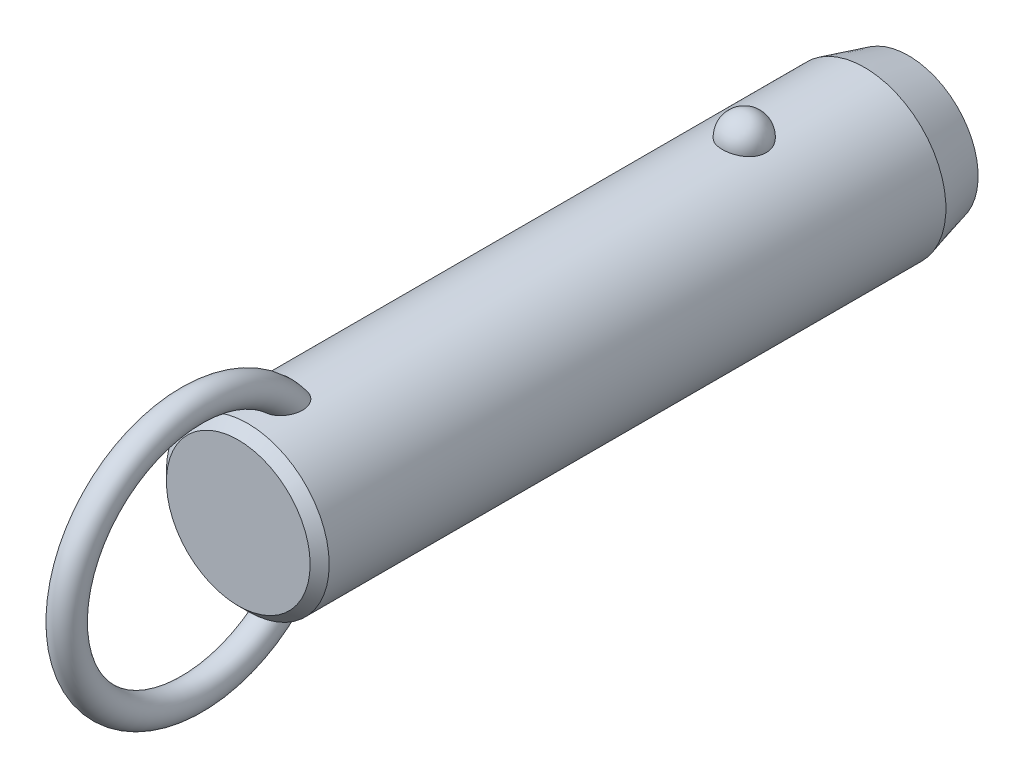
ISO-10303-21;
HEADER;
FILE_DESCRIPTION(('STEP AP214'),'2;1');
FILE_NAME('part.step','',(''),(''),'','','');
FILE_SCHEMA(('AUTOMOTIVE_DESIGN { 1 0 10303 214 1 1 1 1 }'));
ENDSEC;
DATA;
#1=APPLICATION_CONTEXT('core data for automotive mechanical design processes');
#2=APPLICATION_PROTOCOL_DEFINITION('international standard','automotive_design',2000,#1);
#3=PRODUCT_CONTEXT('',#1,'mechanical');
#4=PRODUCT('Part','Part','',(#3));
#5=PRODUCT_RELATED_PRODUCT_CATEGORY('part','',(#4));
#6=PRODUCT_DEFINITION_FORMATION('','',#4);
#7=PRODUCT_DEFINITION_CONTEXT('part definition',#1,'design');
#8=PRODUCT_DEFINITION('design','',#6,#7);
#9=PRODUCT_DEFINITION_SHAPE('','',#8);
#10=(LENGTH_UNIT() NAMED_UNIT(*) SI_UNIT(.MILLI.,.METRE.));
#11=(NAMED_UNIT(*) PLANE_ANGLE_UNIT() SI_UNIT($,.RADIAN.));
#12=(NAMED_UNIT(*) SI_UNIT($,.STERADIAN.) SOLID_ANGLE_UNIT());
#13=UNCERTAINTY_MEASURE_WITH_UNIT(LENGTH_MEASURE(1.E-05),#10,'distance_accuracy_value','');
#14=(GEOMETRIC_REPRESENTATION_CONTEXT(3) GLOBAL_UNCERTAINTY_ASSIGNED_CONTEXT((#13)) GLOBAL_UNIT_ASSIGNED_CONTEXT((#10,
#11,#12)) REPRESENTATION_CONTEXT('',''));
#15=CARTESIAN_POINT('',(0.,0.,0.));
#16=DIRECTION('',(0.,0.,1.));
#17=DIRECTION('',(1.,0.,0.));
#18=AXIS2_PLACEMENT_3D('',#15,#16,#17);
#19=CARTESIAN_POINT('',(0.,0.,53.3));
#20=DIRECTION('',(0.,0.,-1.));
#21=DIRECTION('',(-1.,0.,0.));
#22=AXIS2_PLACEMENT_3D('',#19,#20,#21);
#23=CYLINDRICAL_SURFACE('',#22,11.1);
#24=CARTESIAN_POINT('',(2.9724815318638,10.6945945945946,-3.));
#25=CARTESIAN_POINT('',(2.97247830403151,10.6945972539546,-2.83225059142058));
#26=CARTESIAN_POINT('',(2.95876598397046,10.6984356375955,-2.66445972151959));
#27=CARTESIAN_POINT('',(2.90424529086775,10.7133624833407,-2.33362381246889));
#28=CARTESIAN_POINT('',(2.8634252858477,10.7244540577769,-2.1705808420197));
#29=CARTESIAN_POINT('',(2.75573657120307,10.7526272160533,-1.85396767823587));
#30=CARTESIAN_POINT('',(2.68887937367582,10.7697061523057,-1.70039333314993));
#31=CARTESIAN_POINT('',(2.53079696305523,10.8079438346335,-1.40691598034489));
#32=CARTESIAN_POINT('',(2.43957264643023,10.8291024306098,-1.2670124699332));
#33=CARTESIAN_POINT('',(2.23458150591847,10.8732541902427,-1.00409565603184));
#34=CARTESIAN_POINT('',(2.12071295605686,10.8962553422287,-0.881162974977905));
#35=CARTESIAN_POINT('',(1.87365402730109,10.9414421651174,-0.656352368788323));
#36=CARTESIAN_POINT('',(1.74046358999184,10.9636278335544,-0.554474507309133));
#37=CARTESIAN_POINT('',(1.45872188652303,11.0046495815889,-0.374872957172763));
#38=CARTESIAN_POINT('',(1.31021276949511,11.0234944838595,-0.297085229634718));
#39=CARTESIAN_POINT('',(1.00170030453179,11.0557957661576,-0.167529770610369));
#40=CARTESIAN_POINT('',(0.841698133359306,11.0692526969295,-0.115759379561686));
#41=CARTESIAN_POINT('',(0.517607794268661,11.0890932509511,-0.0403925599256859));
#42=CARTESIAN_POINT('',(0.353633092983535,11.0955916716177,-0.0163383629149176));
#43=CARTESIAN_POINT('',(0.0238420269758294,11.1011989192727,0.0044517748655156));
#44=CARTESIAN_POINT('',(-0.141974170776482,11.1003084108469,0.00119017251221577));
#45=CARTESIAN_POINT('',(-0.468405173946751,11.0912990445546,-0.0323233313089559));
#46=CARTESIAN_POINT('',(-0.629059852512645,11.0832767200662,-0.0622147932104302));
#47=CARTESIAN_POINT('',(-0.942937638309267,11.0609962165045,-0.147645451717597));
#48=CARTESIAN_POINT('',(-1.09616062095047,11.0467379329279,-0.203185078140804));
#49=CARTESIAN_POINT('',(-1.39181061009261,11.0134071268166,-0.3387529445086));
#50=CARTESIAN_POINT('',(-1.53417383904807,10.9943086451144,-0.418913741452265));
#51=CARTESIAN_POINT('',(-1.80342160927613,10.9533667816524,-0.60144882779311));
#52=CARTESIAN_POINT('',(-1.9303046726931,10.9315231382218,-0.703825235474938));
#53=CARTESIAN_POINT('',(-2.16747598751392,10.887005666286,-0.930091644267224));
#54=CARTESIAN_POINT('',(-2.27742774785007,10.8643239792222,-1.05433291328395));
#55=CARTESIAN_POINT('',(-2.47517316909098,10.8209886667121,-1.31966633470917));
#56=CARTESIAN_POINT('',(-2.56296538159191,10.8003351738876,-1.46075958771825));
#57=CARTESIAN_POINT('',(-2.71500300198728,10.7631304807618,-1.75753646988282));
#58=CARTESIAN_POINT('',(-2.77898901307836,10.7466250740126,-1.91335887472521));
#59=CARTESIAN_POINT('',(-2.88046189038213,10.7198747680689,-2.2339152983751));
#60=CARTESIAN_POINT('',(-2.91794947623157,10.709629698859,-2.39864907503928));
#61=CARTESIAN_POINT('',(-2.96537819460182,10.6965949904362,-2.73165170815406));
#62=CARTESIAN_POINT('',(-2.97542891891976,10.693775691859,-2.89990378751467));
#63=CARTESIAN_POINT('',(-2.96804271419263,10.6958279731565,-3.235752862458));
#64=CARTESIAN_POINT('',(-2.95060646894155,10.7006993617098,-3.40334987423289));
#65=CARTESIAN_POINT('',(-2.88883358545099,10.71753912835,-3.73233906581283));
#66=CARTESIAN_POINT('',(-2.84462026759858,10.7294749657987,-3.89375610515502));
#67=CARTESIAN_POINT('',(-2.73050447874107,10.7590797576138,-4.20667949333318));
#68=CARTESIAN_POINT('',(-2.66060103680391,10.7767489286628,-4.35818546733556));
#69=CARTESIAN_POINT('',(-2.49642559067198,10.8159599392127,-4.6478542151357));
#70=CARTESIAN_POINT('',(-2.40203047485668,10.8375211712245,-4.78594458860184));
#71=CARTESIAN_POINT('',(-2.19143488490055,10.8820570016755,-5.0441038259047));
#72=CARTESIAN_POINT('',(-2.07523364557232,10.9050316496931,-5.16417205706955));
#73=CARTESIAN_POINT('',(-1.82361254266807,10.9499219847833,-5.38334833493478));
#74=CARTESIAN_POINT('',(-1.68812945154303,10.9718338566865,-5.48238464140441));
#75=CARTESIAN_POINT('',(-1.40191298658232,11.0120611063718,-5.65618873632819));
#76=CARTESIAN_POINT('',(-1.25118062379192,11.0303767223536,-5.73095813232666));
#77=CARTESIAN_POINT('',(-0.940570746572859,11.0611653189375,-5.85334725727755));
#78=CARTESIAN_POINT('',(-0.780821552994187,11.0737044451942,-5.90127578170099));
#79=CARTESIAN_POINT('',(-0.455204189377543,11.0918598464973,-5.96992976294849));
#80=CARTESIAN_POINT('',(-0.289336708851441,11.0974768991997,-5.99065827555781));
#81=CARTESIAN_POINT('',(0.0406846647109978,11.1011307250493,-6.00418773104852));
#82=CARTESIAN_POINT('',(0.204817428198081,11.099299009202,-5.99747318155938));
#83=CARTESIAN_POINT('',(0.5295530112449,11.088551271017,-5.9574031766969));
#84=CARTESIAN_POINT('',(0.69015594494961,11.0796354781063,-5.92404858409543));
#85=CARTESIAN_POINT('',(1.0027760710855,11.0557204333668,-5.83180084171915));
#86=CARTESIAN_POINT('',(1.15482001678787,11.0407414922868,-5.77299291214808));
#87=CARTESIAN_POINT('',(1.44678373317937,11.0062913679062,-5.63147366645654));
#88=CARTESIAN_POINT('',(1.58670279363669,10.9868199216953,-5.54876095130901));
#89=CARTESIAN_POINT('',(1.8527023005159,10.9451315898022,-5.36027644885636));
#90=CARTESIAN_POINT('',(1.97855158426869,10.9228788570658,-5.25418644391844));
#91=CARTESIAN_POINT('',(2.21080872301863,10.8782509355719,-5.02251354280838));
#92=CARTESIAN_POINT('',(2.31721312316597,10.8558757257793,-4.89692718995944));
#93=CARTESIAN_POINT('',(2.5094551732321,10.8130715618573,-4.62745408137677));
#94=CARTESIAN_POINT('',(2.59493284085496,10.7926798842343,-4.48330448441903));
#95=CARTESIAN_POINT('',(2.740862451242,10.7565495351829,-4.18236358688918));
#96=CARTESIAN_POINT('',(2.80132490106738,10.7408089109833,-4.02557762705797));
#97=CARTESIAN_POINT('',(2.88959070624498,10.7173718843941,-3.72475308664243));
#98=CARTESIAN_POINT('',(2.92062102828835,10.7088950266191,-3.58171216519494));
#99=CARTESIAN_POINT('',(2.96206765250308,10.6975052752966,-3.29245795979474));
#100=CARTESIAN_POINT('',(2.97248434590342,10.6945922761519,-3.14624473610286));
#101=CARTESIAN_POINT('',(2.9724815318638,10.6945945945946,-3.));
#102=B_SPLINE_CURVE_WITH_KNOTS('',3,(#24,#25,#26,#27,#28,#29,#30,#31,#32,#33,#34,#35,#36,#37,
#38,#39,#40,#41,#42,#43,#44,#45,#46,#47,#48,#49,#50,#51,#52,#53,#54,#55,#56,#57,#58,#59,#60,#61,
#62,#63,#64,#65,#66,#67,#68,#69,#70,#71,#72,#73,#74,#75,#76,#77,#78,#79,#80,#81,#82,#83,#84,#85,
#86,#87,#88,#89,#90,#91,#92,#93,#94,#95,#96,#97,#98,#99,#100,#101),.UNSPECIFIED.,.T.,.F.,(4,2,2,
2,2,2,2,2,2,2,2,2,2,2,2,2,2,2,2,2,2,2,2,2,2,2,2,2,2,2,2,2,2,2,2,2,2,2,4),(0.,0.502722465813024,
1.00566079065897,1.5083769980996,2.01107471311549,2.51608392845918,3.02109467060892,
3.52475118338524,4.02835620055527,4.523518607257,5.0186364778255,5.50715297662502,
5.9956776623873,6.48688002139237,6.97812923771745,7.47814366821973,7.9781907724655,
8.48353712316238,8.9888697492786,9.49218093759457,9.99547960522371,10.4964777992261,
10.997494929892,11.5010810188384,12.0046847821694,12.5099796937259,13.0152411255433,
13.5145635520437,14.0138298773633,14.5043200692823,14.9947943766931,15.4836390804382,
15.9725123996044,16.4685040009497,16.9645836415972,17.4686765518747,17.972557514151,
18.410841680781,18.849117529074),.UNSPECIFIED.);
#103=CARTESIAN_POINT('',(2.9724815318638,10.6945945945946,-3.));
#104=VERTEX_POINT('',#103);
#105=EDGE_CURVE('E41',#104,#104,#102,.T.);
#106=ORIENTED_EDGE('',*,*,#105,.T.);
#107=EDGE_LOOP('',(#106));
#108=FACE_BOUND('',#107,.T.);
#109=CARTESIAN_POINT('',(0.,0.,64.7));
#110=DIRECTION('',(0.,0.,1.));
#111=DIRECTION('',(1.,0.,0.));
#112=AXIS2_PLACEMENT_3D('',#109,#110,#111);
#113=CIRCLE('',#112,11.1);
#114=CARTESIAN_POINT('',(11.1,0.,64.7));
#115=VERTEX_POINT('',#114);
#116=EDGE_CURVE('E10',#115,#115,#113,.F.);
#117=ORIENTED_EDGE('',*,*,#116,.T.);
#118=EDGE_LOOP('',(#117));
#119=FACE_BOUND('',#118,.T.);
#120=CARTESIAN_POINT('',(-0.56452033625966,-11.0856356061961,56.9578154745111));
#121=CARTESIAN_POINT('',(-0.66720283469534,-11.0804062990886,56.9912839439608));
#122=CARTESIAN_POINT('',(-0.766875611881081,-11.0738877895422,57.0338357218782));
#123=CARTESIAN_POINT('',(-0.957284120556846,-11.0590576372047,57.1354190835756));
#124=CARTESIAN_POINT('',(-1.04801616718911,-11.0507452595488,57.1944574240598));
#125=CARTESIAN_POINT('',(-1.21800952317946,-11.0333016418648,57.3265293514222));
#126=CARTESIAN_POINT('',(-1.29730805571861,-11.0241732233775,57.3995156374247));
#127=CARTESIAN_POINT('',(-1.44337665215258,-11.0060026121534,57.5570374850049));
#128=CARTESIAN_POINT('',(-1.51014622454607,-10.9969604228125,57.6415734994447));
#129=CARTESIAN_POINT('',(-1.63454620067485,-10.9791841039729,57.8255213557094));
#130=CARTESIAN_POINT('',(-1.69127003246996,-10.9705107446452,57.9255493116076));
#131=CARTESIAN_POINT('',(-1.78980785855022,-10.9548648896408,58.1327902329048));
#132=CARTESIAN_POINT('',(-1.83161214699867,-10.9478935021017,58.2400078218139));
#133=CARTESIAN_POINT('',(-1.91557028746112,-10.9335803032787,58.5054080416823));
#134=CARTESIAN_POINT('',(-1.95040620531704,-10.9273269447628,58.6659806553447));
#135=CARTESIAN_POINT('',(-1.99388326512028,-10.9194709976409,58.9906977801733));
#136=CARTESIAN_POINT('',(-2.00248051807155,-10.9178762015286,59.1548478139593));
#137=CARTESIAN_POINT('',(-1.99551615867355,-10.9191578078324,59.5246504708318));
#138=CARTESIAN_POINT('',(-1.9732206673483,-10.9232807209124,59.7301911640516));
#139=CARTESIAN_POINT('',(-1.9152976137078,-10.9335244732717,60.033595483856));
#140=CARTESIAN_POINT('',(-1.89184575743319,-10.9376266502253,60.1340883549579));
#141=CARTESIAN_POINT('',(-1.83700674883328,-10.9469720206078,60.332855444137));
#142=CARTESIAN_POINT('',(-1.80562070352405,-10.9522150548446,60.4311299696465));
#143=CARTESIAN_POINT('',(-1.73463055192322,-10.9636837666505,60.6259148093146));
#144=CARTESIAN_POINT('',(-1.69493416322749,-10.9699202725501,60.7223907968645));
#145=CARTESIAN_POINT('',(-1.60745141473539,-10.9830806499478,60.9116262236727));
#146=CARTESIAN_POINT('',(-1.55966150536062,-10.9900048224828,61.0043840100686));
#147=CARTESIAN_POINT('',(-1.45591812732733,-11.0042280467,61.1846907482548));
#148=CARTESIAN_POINT('',(-1.40000013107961,-11.0115253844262,61.2722601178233));
#149=CARTESIAN_POINT('',(-1.2793747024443,-11.0261911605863,61.441029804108));
#150=CARTESIAN_POINT('',(-1.21467835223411,-11.0335594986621,61.5222379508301));
#151=CARTESIAN_POINT('',(-1.08218150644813,-11.0473027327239,61.6690010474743));
#152=CARTESIAN_POINT('',(-1.0152263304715,-11.0537063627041,61.7353092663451));
#153=CARTESIAN_POINT('',(-0.872952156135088,-11.065850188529,61.8583780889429));
#154=CARTESIAN_POINT('',(-0.797642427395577,-11.0715911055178,61.9151491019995));
#155=CARTESIAN_POINT('',(-0.651396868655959,-11.081071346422,62.0075155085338));
#156=CARTESIAN_POINT('',(-0.581712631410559,-11.0849841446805,62.0450491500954));
#157=CARTESIAN_POINT('',(-0.4370660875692,-11.0916271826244,62.1082594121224));
#158=CARTESIAN_POINT('',(-0.362109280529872,-11.0943586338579,62.1339481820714));
#159=CARTESIAN_POINT('',(-0.207828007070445,-11.0983242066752,62.171117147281));
#160=CARTESIAN_POINT('',(-0.128467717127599,-11.0995432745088,62.1824545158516));
#161=CARTESIAN_POINT('',(0.0309101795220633,-11.1002423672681,62.1889658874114));
#162=CARTESIAN_POINT('',(0.110927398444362,-11.0997233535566,62.1841488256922));
#163=CARTESIAN_POINT('',(0.256406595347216,-11.097240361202,62.1609599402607));
#164=CARTESIAN_POINT('',(0.322235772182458,-11.0955074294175,62.1447543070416));
#165=CARTESIAN_POINT('',(0.450635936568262,-11.0910350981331,62.1026008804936));
#166=CARTESIAN_POINT('',(0.513205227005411,-11.0882951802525,62.0766480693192));
#167=CARTESIAN_POINT('',(0.66262634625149,-11.0805620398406,62.0026073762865));
#168=CARTESIAN_POINT('',(0.747127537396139,-11.0751144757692,61.9498452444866));
#169=CARTESIAN_POINT('',(0.906756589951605,-11.0631932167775,61.8317206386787));
#170=CARTESIAN_POINT('',(0.981859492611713,-11.0567168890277,61.7663257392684));
#171=CARTESIAN_POINT('',(1.1071220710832,-11.0447856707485,61.6422633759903));
#172=CARTESIAN_POINT('',(1.15909566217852,-11.0394280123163,61.5853831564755));
#173=CARTESIAN_POINT('',(1.25791923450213,-11.0286040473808,61.4673271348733));
#174=CARTESIAN_POINT('',(1.30476642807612,-11.0231376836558,61.4061490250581));
#175=CARTESIAN_POINT('',(1.43818612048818,-11.0068027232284,61.217305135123));
#176=CARTESIAN_POINT('',(1.51751767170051,-10.9960104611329,61.0844531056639));
#177=CARTESIAN_POINT('',(1.63597546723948,-10.9788847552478,60.8531371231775));
#178=CARTESIAN_POINT('',(1.67988876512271,-10.9722190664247,60.7570530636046));
#179=CARTESIAN_POINT('',(1.75953241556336,-10.9597298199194,60.5614311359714));
#180=CARTESIAN_POINT('',(1.79525967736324,-10.9539065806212,60.4618919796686));
#181=CARTESIAN_POINT('',(1.85844731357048,-10.9433632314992,60.2602111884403));
#182=CARTESIAN_POINT('',(1.88591073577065,-10.9386427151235,60.1580705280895));
#183=CARTESIAN_POINT('',(1.93234324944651,-10.9305350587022,59.951819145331));
#184=CARTESIAN_POINT('',(1.95131065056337,-10.9271481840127,59.8477080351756));
#185=CARTESIAN_POINT('',(1.99040203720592,-10.9201183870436,59.5654588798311));
#186=CARTESIAN_POINT('',(2.00221217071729,-10.9179256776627,59.3860370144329));
#187=CARTESIAN_POINT('',(1.99711676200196,-10.9188636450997,59.0277133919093));
#188=CARTESIAN_POINT('',(1.98026150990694,-10.9219849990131,58.848811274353));
#189=CARTESIAN_POINT('',(1.92151657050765,-10.9324473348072,58.5364514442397));
#190=CARTESIAN_POINT('',(1.88605081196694,-10.9386915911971,58.4017594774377));
#191=CARTESIAN_POINT('',(1.79393020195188,-10.9541780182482,58.1399669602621));
#192=CARTESIAN_POINT('',(1.73729868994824,-10.9634168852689,58.0128582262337));
#193=CARTESIAN_POINT('',(1.61237037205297,-10.9824218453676,57.7894184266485));
#194=CARTESIAN_POINT('',(1.54715374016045,-10.9918945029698,57.6913455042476));
#195=CARTESIAN_POINT('',(1.40127026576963,-11.0114415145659,57.5074341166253));
#196=CARTESIAN_POINT('',(1.3206074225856,-11.0215157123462,57.4215924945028));
#197=CARTESIAN_POINT('',(1.1447478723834,-11.041168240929,57.2651630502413));
#198=CARTESIAN_POINT('',(1.0494780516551,-11.0507437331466,57.1946565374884));
#199=CARTESIAN_POINT('',(0.847278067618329,-11.0680789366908,57.072640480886));
#200=CARTESIAN_POINT('',(0.740351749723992,-11.0758392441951,57.0211246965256));
#201=CARTESIAN_POINT('',(0.52928931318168,-11.0878275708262,56.9434852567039));
#202=CARTESIAN_POINT('',(0.425895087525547,-11.0923259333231,56.915377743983));
#203=CARTESIAN_POINT('',(0.215723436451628,-11.0984001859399,56.8777038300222));
#204=CARTESIAN_POINT('',(0.108947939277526,-11.0999777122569,56.8681270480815));
#205=CARTESIAN_POINT('',(-0.093896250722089,-11.1000196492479,56.8678773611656));
#206=CARTESIAN_POINT('',(-0.189967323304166,-11.0987797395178,56.8754089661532));
#207=CARTESIAN_POINT('',(-0.379657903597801,-11.0939111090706,56.9055079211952));
#208=CARTESIAN_POINT('',(-0.473277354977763,-11.0902823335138,56.9280756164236));
#209=CARTESIAN_POINT('',(-0.56452033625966,-11.0856356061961,56.9578154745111));
#210=B_SPLINE_CURVE_WITH_KNOTS('',3,(#120,#121,#122,#123,#124,#125,#126,#127,#128,#129,#130,
#131,#132,#133,#134,#135,#136,#137,#138,#139,#140,#141,#142,#143,#144,#145,#146,#147,#148,#149,
#150,#151,#152,#153,#154,#155,#156,#157,#158,#159,#160,#161,#162,#163,#164,#165,#166,#167,#168,
#169,#170,#171,#172,#173,#174,#175,#176,#177,#178,#179,#180,#181,#182,#183,#184,#185,#186,#187,
#188,#189,#190,#191,#192,#193,#194,#195,#196,#197,#198,#199,#200,#201,#202,#203,#204,#205,#206,
#207,#208,#209),.UNSPECIFIED.,.T.,.F.,(4,2,2,2,2,2,2,2,2,2,2,2,2,2,2,2,2,2,2,2,2,2,2,2,2,2,2,2,
2,2,2,2,2,2,2,2,2,2,2,2,2,2,2,2,4),(0.,0.323999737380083,0.648132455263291,0.971184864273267,
1.29424994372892,1.63886237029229,1.98369857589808,2.47426059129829,2.96564271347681,
3.5825739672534,3.89215258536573,4.20168803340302,4.51486273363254,4.82817514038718,
5.14015911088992,5.45175282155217,5.734428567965,6.01679375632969,6.25364580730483,
6.49025437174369,6.72919963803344,6.9680127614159,7.17061258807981,7.37331685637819,
7.67094989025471,7.96935728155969,8.20075067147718,8.43226927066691,8.8958162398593,
9.21306533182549,9.53043400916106,9.84768549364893,10.1650000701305,10.70229304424,
11.2386443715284,11.6553390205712,12.0715755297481,12.4245637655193,12.7774607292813,
13.1321855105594,13.4867936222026,13.8068771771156,14.1267813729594,14.4146787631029,
14.7025827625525),.UNSPECIFIED.);
#211=CARTESIAN_POINT('',(-0.56452033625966,-11.0856356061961,56.9578154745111));
#212=VERTEX_POINT('',#211);
#213=EDGE_CURVE('E59',#212,#212,#210,.T.);
#214=ORIENTED_EDGE('',*,*,#213,.T.);
#215=EDGE_LOOP('',(#214));
#216=FACE_BOUND('',#215,.T.);
#217=CARTESIAN_POINT('',(-0.56452033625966,11.0856356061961,56.9578154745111));
#218=CARTESIAN_POINT('',(-0.468542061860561,11.0905203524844,56.9265456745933));
#219=CARTESIAN_POINT('',(-0.369793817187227,11.0942886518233,56.9031576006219));
#220=CARTESIAN_POINT('',(-0.169555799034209,11.0991586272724,56.8730858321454));
#221=CARTESIAN_POINT('',(-0.0680604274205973,11.1002543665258,56.8664393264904));
#222=CARTESIAN_POINT('',(0.134549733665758,11.099646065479,56.8701579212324));
#223=CARTESIAN_POINT('',(0.235664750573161,11.0979441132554,56.8805103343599));
#224=CARTESIAN_POINT('',(0.434632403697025,11.0919342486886,56.9178318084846));
#225=CARTESIAN_POINT('',(0.532486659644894,11.0876276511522,56.9447924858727));
#226=CARTESIAN_POINT('',(0.722445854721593,11.0768742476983,57.0144096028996));
#227=CARTESIAN_POINT('',(0.814543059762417,11.0704246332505,57.0570866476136));
#228=CARTESIAN_POINT('',(0.990565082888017,11.0560659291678,57.1566487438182));
#229=CARTESIAN_POINT('',(1.07448844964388,11.048156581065,57.2135363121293));
#230=CARTESIAN_POINT('',(1.23562672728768,11.0313221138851,57.3422106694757));
#231=CARTESIAN_POINT('',(1.31242684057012,11.0223686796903,57.4145117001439));
#232=CARTESIAN_POINT('',(1.45398030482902,11.0045918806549,57.5700425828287));
#233=CARTESIAN_POINT('',(1.51873073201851,10.9957685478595,57.6532750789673));
#234=CARTESIAN_POINT('',(1.64107232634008,10.9782087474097,57.8363842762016));
#235=CARTESIAN_POINT('',(1.6974317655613,10.9695572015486,57.9370893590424));
#236=CARTESIAN_POINT('',(1.79515063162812,10.9539887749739,58.1456264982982));
#237=CARTESIAN_POINT('',(1.83649966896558,10.9470730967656,58.2534634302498));
#238=CARTESIAN_POINT('',(1.91931148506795,10.9329211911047,58.5203995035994));
#239=CARTESIAN_POINT('',(1.95340104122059,10.9267904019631,58.6818612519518));
#240=CARTESIAN_POINT('',(1.99526195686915,10.9192174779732,59.0082163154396));
#241=CARTESIAN_POINT('',(2.00298989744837,10.9177830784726,59.1731148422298));
#242=CARTESIAN_POINT('',(1.99396251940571,10.9194420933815,59.5441006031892));
#243=CARTESIAN_POINT('',(1.97050829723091,10.923774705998,59.7500387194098));
#244=CARTESIAN_POINT('',(1.91079643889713,10.9343131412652,60.0539019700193));
#245=CARTESIAN_POINT('',(1.8867370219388,10.9385106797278,60.1545296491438));
#246=CARTESIAN_POINT('',(1.83065508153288,10.9480376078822,60.3535107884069));
#247=CARTESIAN_POINT('',(1.79863369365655,10.9533668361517,60.451864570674));
#248=CARTESIAN_POINT('',(1.72633365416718,10.9649954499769,60.6467203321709));
#249=CARTESIAN_POINT('',(1.68596409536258,10.9713053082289,60.7431879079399));
#250=CARTESIAN_POINT('',(1.59707998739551,10.9845964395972,60.9323233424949));
#251=CARTESIAN_POINT('',(1.54856169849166,10.9915780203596,61.0249894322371));
#252=CARTESIAN_POINT('',(1.4433016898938,11.0058935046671,61.2049752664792));
#253=CARTESIAN_POINT('',(1.38659749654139,11.0132257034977,61.292316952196));
#254=CARTESIAN_POINT('',(1.26431158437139,11.0279330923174,61.4604563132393));
#255=CARTESIAN_POINT('',(1.198741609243,11.0353082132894,61.5412624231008));
#256=CARTESIAN_POINT('',(1.06542088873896,11.048931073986,61.6859856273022));
#257=CARTESIAN_POINT('',(0.998640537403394,11.0552153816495,61.750784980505));
#258=CARTESIAN_POINT('',(0.856896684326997,11.0671032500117,61.8708462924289));
#259=CARTESIAN_POINT('',(0.781942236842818,11.0727075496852,61.9261186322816));
#260=CARTESIAN_POINT('',(0.636276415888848,11.081949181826,62.0159721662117));
#261=CARTESIAN_POINT('',(0.566755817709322,11.0857572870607,62.0524410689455));
#262=CARTESIAN_POINT('',(0.422602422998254,11.0921860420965,62.1135333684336));
#263=CARTESIAN_POINT('',(0.347974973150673,11.0948079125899,62.1381689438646));
#264=CARTESIAN_POINT('',(0.194593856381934,11.0985608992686,62.1733233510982));
#265=CARTESIAN_POINT('',(0.11580793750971,11.0996777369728,62.1837069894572));
#266=CARTESIAN_POINT('',(-0.0422499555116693,11.1002003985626,62.1885747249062));
#267=CARTESIAN_POINT('',(-0.121521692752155,11.09960699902,62.183066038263));
#268=CARTESIAN_POINT('',(-0.266046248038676,11.0970123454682,62.1588271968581));
#269=CARTESIAN_POINT('',(-0.331661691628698,11.0952283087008,62.1421356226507));
#270=CARTESIAN_POINT('',(-0.459588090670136,11.0906663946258,62.0991117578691));
#271=CARTESIAN_POINT('',(-0.521897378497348,11.0878880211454,62.072774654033));
#272=CARTESIAN_POINT('',(-0.671446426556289,11.0800342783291,61.9975130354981));
#273=CARTESIAN_POINT('',(-0.756250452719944,11.0744969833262,61.9438182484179));
#274=CARTESIAN_POINT('',(-0.916349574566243,11.0624045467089,61.8238029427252));
#275=CARTESIAN_POINT('',(-0.991618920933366,11.0558467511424,61.7574493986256));
#276=CARTESIAN_POINT('',(-1.11713140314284,11.0437783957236,61.6316335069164));
#277=CARTESIAN_POINT('',(-1.16920539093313,11.0383619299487,61.5739524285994));
#278=CARTESIAN_POINT('',(-1.26817476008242,11.02743010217,61.4542809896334));
#279=CARTESIAN_POINT('',(-1.315067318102,11.0219146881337,61.3922883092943));
#280=CARTESIAN_POINT('',(-1.40399813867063,11.0109399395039,61.2647843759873));
#281=CARTESIAN_POINT('',(-1.4460286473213,11.0054807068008,61.1992677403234));
#282=CARTESIAN_POINT('',(-1.52538779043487,10.9947621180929,61.0654223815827));
#283=CARTESIAN_POINT('',(-1.56271516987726,10.9895028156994,60.9970929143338));
#284=CARTESIAN_POINT('',(-1.64537943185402,10.9774790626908,60.8332101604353));
#285=CARTESIAN_POINT('',(-1.68879497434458,10.9708503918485,60.7366735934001));
#286=CARTESIAN_POINT('',(-1.76740738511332,10.9584602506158,60.5402369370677));
#287=CARTESIAN_POINT('',(-1.80260120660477,10.95269910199,60.4403356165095));
#288=CARTESIAN_POINT('',(-1.86468657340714,10.9423003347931,60.2379663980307));
#289=CARTESIAN_POINT('',(-1.8915816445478,10.9376622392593,60.1354996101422));
#290=CARTESIAN_POINT('',(-1.93682458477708,10.9297405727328,59.9286429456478));
#291=CARTESIAN_POINT('',(-1.95517082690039,10.9264572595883,59.8242527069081));
#292=CARTESIAN_POINT('',(-1.99232562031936,10.9197647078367,59.5426287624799));
#293=CARTESIAN_POINT('',(-2.00294603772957,10.9177914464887,59.3641857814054));
#294=CARTESIAN_POINT('',(-1.99566675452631,10.9191290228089,59.0079962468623));
#295=CARTESIAN_POINT('',(-1.97781651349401,10.9224306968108,58.8302490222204));
#296=CARTESIAN_POINT('',(-1.91747214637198,10.9331592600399,58.5197921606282));
#297=CARTESIAN_POINT('',(-1.88131022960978,10.9395108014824,58.385825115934));
#298=CARTESIAN_POINT('',(-1.78790380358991,10.9551659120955,58.1255975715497));
#299=CARTESIAN_POINT('',(-1.73068309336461,10.9644661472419,57.9993285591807));
#300=CARTESIAN_POINT('',(-1.60475573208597,10.9835398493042,57.7774156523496));
#301=CARTESIAN_POINT('',(-1.53908879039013,10.9930297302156,57.6800265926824));
#302=CARTESIAN_POINT('',(-1.39238608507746,11.0125708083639,57.4975250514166));
#303=CARTESIAN_POINT('',(-1.31135150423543,11.0226219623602,57.4124116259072));
#304=CARTESIAN_POINT('',(-1.14382035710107,11.0411991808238,57.2652994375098));
#305=CARTESIAN_POINT('',(-1.05858500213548,11.0497792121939,57.2018693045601));
#306=CARTESIAN_POINT('',(-0.878723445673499,11.0655285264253,57.0902505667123));
#307=CARTESIAN_POINT('',(-0.784123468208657,11.0727015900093,57.0420208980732));
#308=CARTESIAN_POINT('',(-0.646163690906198,11.0812501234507,56.986023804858));
#309=CARTESIAN_POINT('',(-0.605595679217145,11.0835451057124,56.9711978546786));
#310=CARTESIAN_POINT('',(-0.56452033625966,11.0856356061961,56.9578154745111));
#311=B_SPLINE_CURVE_WITH_KNOTS('',3,(#217,#218,#219,#220,#221,#222,#223,#224,#225,#226,#227,
#228,#229,#230,#231,#232,#233,#234,#235,#236,#237,#238,#239,#240,#241,#242,#243,#244,#245,#246,
#247,#248,#249,#250,#251,#252,#253,#254,#255,#256,#257,#258,#259,#260,#261,#262,#263,#264,#265,
#266,#267,#268,#269,#270,#271,#272,#273,#274,#275,#276,#277,#278,#279,#280,#281,#282,#283,#284,
#285,#286,#287,#288,#289,#290,#291,#292,#293,#294,#295,#296,#297,#298,#299,#300,#301,#302,#303,
#304,#305,#306,#307,#308,#309,#310),.UNSPECIFIED.,.T.,.F.,(4,2,2,2,2,2,2,2,2,2,2,2,2,2,2,2,2,2,
2,2,2,2,2,2,2,2,2,2,2,2,2,2,2,2,2,2,2,2,2,2,2,2,2,2,2,2,4),(0.,0.303061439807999,
0.60679549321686,0.910302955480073,1.21365733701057,1.51741085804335,1.82121821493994,
2.13745205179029,2.45376252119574,2.799586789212,3.14564996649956,3.63832391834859,
4.13180893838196,4.75031912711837,5.06071926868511,5.37107516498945,5.68500772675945,
5.99908475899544,6.3117651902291,6.62403542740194,6.90315673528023,7.18197194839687,
7.41687778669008,7.65154134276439,7.8884158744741,8.12518286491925,8.32752842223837,
8.52997509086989,8.82986421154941,9.13054668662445,9.36393502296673,9.59744991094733,
9.83133221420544,10.0652767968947,10.383032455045,10.7009056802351,11.0186436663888,
11.3364420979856,11.8705925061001,12.4038159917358,12.8189662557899,13.2336487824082,
13.5857049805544,13.9377340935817,14.2561354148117,14.5736690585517,14.7033687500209),.UNSPECIFIED.);
#312=CARTESIAN_POINT('',(-0.56452033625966,11.0856356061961,56.9578154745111));
#313=VERTEX_POINT('',#312);
#314=EDGE_CURVE('E67',#313,#313,#311,.T.);
#315=ORIENTED_EDGE('',*,*,#314,.T.);
#316=EDGE_LOOP('',(#315));
#317=FACE_BOUND('',#316,.T.);
#318=CARTESIAN_POINT('',(0.,0.,-19.3999999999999));
#319=DIRECTION('',(0.,0.,-1.));
#320=DIRECTION('',(-1.,0.,0.));
#321=AXIS2_PLACEMENT_3D('',#318,#319,#320);
#322=CIRCLE('',#321,11.1);
#323=CARTESIAN_POINT('',(-11.1,0.,-19.3999999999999));
#324=VERTEX_POINT('',#323);
#325=EDGE_CURVE('E56',#324,#324,#322,.F.);
#326=ORIENTED_EDGE('',*,*,#325,.T.);
#327=EDGE_LOOP('',(#326));
#328=FACE_BOUND('',#327,.T.);
#329=ADVANCED_FACE('F37',(#108,#119,#216,#317,#328),#23,.T.);
#330=CARTESIAN_POINT('',(0.,0.,-25.4));
#331=DIRECTION('',(0.,0.,-1.));
#332=DIRECTION('',(-1.,0.,0.));
#333=AXIS2_PLACEMENT_3D('',#330,#331,#332);
#334=PLANE('',#333);
#335=CARTESIAN_POINT('',(0.,0.,-25.4));
#336=DIRECTION('',(0.,0.,-1.));
#337=DIRECTION('',(-1.,0.,0.));
#338=AXIS2_PLACEMENT_3D('',#335,#336,#337);
#339=CIRCLE('',#338,9.49230484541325);
#340=CARTESIAN_POINT('',(-9.49230484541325,0.,-25.4));
#341=VERTEX_POINT('',#340);
#342=EDGE_CURVE('E66',#341,#341,#339,.T.);
#343=ORIENTED_EDGE('',*,*,#342,.T.);
#344=EDGE_LOOP('',(#343));
#345=FACE_BOUND('',#344,.T.);
#346=ADVANCED_FACE('F85',(#345),#334,.T.);
#347=CARTESIAN_POINT('',(0.,0.,-25.4));
#348=DIRECTION('',(0.,0.,1.));
#349=DIRECTION('',(1.,0.,0.));
#350=AXIS2_PLACEMENT_3D('',#347,#348,#349);
#351=CONICAL_SURFACE('',#350,9.49230484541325,0.261799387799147);
#352=ORIENTED_EDGE('',*,*,#325,.F.);
#353=EDGE_LOOP('',(#352));
#354=FACE_BOUND('',#353,.T.);
#355=ORIENTED_EDGE('',*,*,#342,.F.);
#356=EDGE_LOOP('',(#355));
#357=FACE_BOUND('',#356,.T.);
#358=ADVANCED_FACE('F83',(#354,#357),#351,.T.);
#359=CARTESIAN_POINT('',(0.,0.,66.));
#360=DIRECTION('',(0.,0.,1.));
#361=DIRECTION('',(1.,0.,0.));
#362=AXIS2_PLACEMENT_3D('',#359,#360,#361);
#363=PLANE('',#362);
#364=CARTESIAN_POINT('',(0.,0.,66.));
#365=DIRECTION('',(0.,0.,1.));
#366=DIRECTION('',(1.,0.,0.));
#367=AXIS2_PLACEMENT_3D('',#364,#365,#366);
#368=CIRCLE('',#367,9.80000000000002);
#369=CARTESIAN_POINT('',(9.80000000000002,0.,66.));
#370=VERTEX_POINT('',#369);
#371=EDGE_CURVE('E50',#370,#370,#368,.T.);
#372=ORIENTED_EDGE('',*,*,#371,.T.);
#373=EDGE_LOOP('',(#372));
#374=FACE_BOUND('',#373,.T.);
#375=ADVANCED_FACE('F77',(#374),#363,.T.);
#376=CARTESIAN_POINT('',(0.,0.,72.35));
#377=DIRECTION('',(1.,0.,0.));
#378=DIRECTION('',(0.,0.,-1.));
#379=AXIS2_PLACEMENT_3D('',#376,#377,#378);
#380=TOROIDAL_SURFACE('',#379,17.05,2.);
#381=ORIENTED_EDGE('',*,*,#314,.F.);
#382=EDGE_LOOP('',(#381));
#383=FACE_BOUND('',#382,.T.);
#384=ORIENTED_EDGE('',*,*,#213,.F.);
#385=EDGE_LOOP('',(#384));
#386=FACE_BOUND('',#385,.T.);
#387=ADVANCED_FACE('F73',(#383,#386),#380,.T.);
#388=CARTESIAN_POINT('',(0.,0.,66.));
#389=DIRECTION('',(0.,0.,-1.));
#390=DIRECTION('',(-1.,0.,0.));
#391=AXIS2_PLACEMENT_3D('',#388,#389,#390);
#392=CONICAL_SURFACE('',#391,9.80000000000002,0.785398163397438);
#393=ORIENTED_EDGE('',*,*,#116,.F.);
#394=EDGE_LOOP('',(#393));
#395=FACE_BOUND('',#394,.T.);
#396=ORIENTED_EDGE('',*,*,#371,.F.);
#397=EDGE_LOOP('',(#396));
#398=FACE_BOUND('',#397,.T.);
#399=ADVANCED_FACE('F39',(#395,#398),#392,.T.);
#400=CARTESIAN_POINT('',(0.,11.1,-3.));
#401=DIRECTION('',(0.,1.,0.));
#402=DIRECTION('',(0.,0.,-1.));
#403=AXIS2_PLACEMENT_3D('',#400,#401,#402);
#404=SPHERICAL_SURFACE('',#403,3.);
#405=ORIENTED_EDGE('',*,*,#105,.F.);
#406=EDGE_LOOP('',(#405));
#407=FACE_BOUND('',#406,.T.);
#408=ADVANCED_FACE('F79',(#407),#404,.T.);
#409=CLOSED_SHELL('',(#329,#346,#358,#375,#387,#399,#408));
#410=MANIFOLD_SOLID_BREP('B2',#409);
#411=ADVANCED_BREP_SHAPE_REPRESENTATION('',(#18,#410),#14);
#412=SHAPE_DEFINITION_REPRESENTATION(#9,#411);
ENDSEC;
END-ISO-10303-21;
